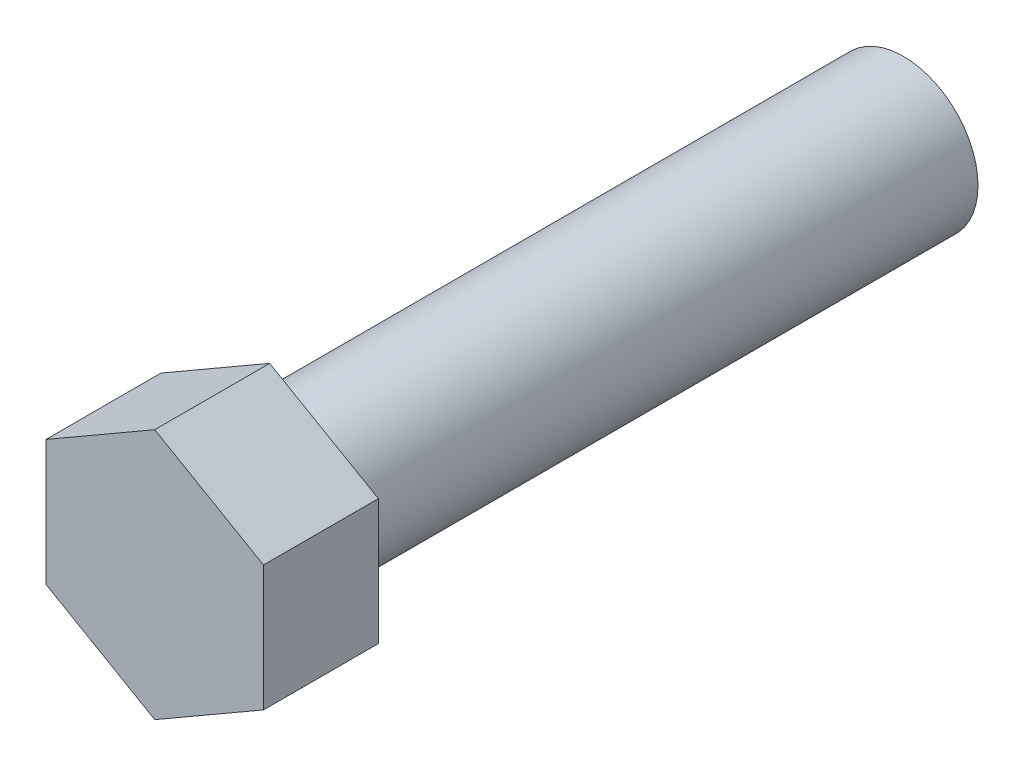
ISO-10303-21;
HEADER;
FILE_DESCRIPTION(('STEP AP214'),'2;1');
FILE_NAME('part.step','',(''),(''),'','','');
FILE_SCHEMA(('AUTOMOTIVE_DESIGN { 1 0 10303 214 1 1 1 1 }'));
ENDSEC;
DATA;
#1=APPLICATION_CONTEXT('core data for automotive mechanical design processes');
#2=APPLICATION_PROTOCOL_DEFINITION('international standard','automotive_design',2000,#1);
#3=PRODUCT_CONTEXT('',#1,'mechanical');
#4=PRODUCT('Part','Part','',(#3));
#5=PRODUCT_RELATED_PRODUCT_CATEGORY('part','',(#4));
#6=PRODUCT_DEFINITION_FORMATION('','',#4);
#7=PRODUCT_DEFINITION_CONTEXT('part definition',#1,'design');
#8=PRODUCT_DEFINITION('design','',#6,#7);
#9=PRODUCT_DEFINITION_SHAPE('','',#8);
#10=(LENGTH_UNIT() NAMED_UNIT(*) SI_UNIT(.MILLI.,.METRE.));
#11=(NAMED_UNIT(*) PLANE_ANGLE_UNIT() SI_UNIT($,.RADIAN.));
#12=(NAMED_UNIT(*) SI_UNIT($,.STERADIAN.) SOLID_ANGLE_UNIT());
#13=UNCERTAINTY_MEASURE_WITH_UNIT(LENGTH_MEASURE(1.E-05),#10,'distance_accuracy_value','');
#14=(GEOMETRIC_REPRESENTATION_CONTEXT(3) GLOBAL_UNCERTAINTY_ASSIGNED_CONTEXT((#13)) GLOBAL_UNIT_ASSIGNED_CONTEXT((#10,
#11,#12)) REPRESENTATION_CONTEXT('',''));
#15=CARTESIAN_POINT('',(0.,0.,0.));
#16=DIRECTION('',(0.,0.,1.));
#17=DIRECTION('',(1.,0.,0.));
#18=AXIS2_PLACEMENT_3D('',#15,#16,#17);
#19=CARTESIAN_POINT('',(55.5625000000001,32.0790243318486,58.7375));
#20=DIRECTION('',(-0.5,-0.866025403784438,0.));
#21=DIRECTION('',(0.866025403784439,-0.5,0.));
#22=AXIS2_PLACEMENT_3D('',#19,#20,#21);
#23=PLANE('',#22);
#24=DIRECTION('',(-0.866025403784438,0.5,0.));
#25=VECTOR('',#24,1.);
#26=CARTESIAN_POINT('',(55.5625000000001,32.0790243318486,0.));
#27=LINE('',#26,#25);
#28=CARTESIAN_POINT('',(55.5625000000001,32.0790243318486,0.));
#29=VERTEX_POINT('',#28);
#30=CARTESIAN_POINT('',(0.,64.1580486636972,0.));
#31=VERTEX_POINT('',#30);
#32=EDGE_CURVE('E133',#29,#31,#27,.T.);
#33=ORIENTED_EDGE('',*,*,#32,.T.);
#34=DIRECTION('',(0.,0.,-1.));
#35=VECTOR('',#34,1.);
#36=CARTESIAN_POINT('',(0.,64.1580486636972,58.7375));
#37=LINE('',#36,#35);
#38=CARTESIAN_POINT('',(0.,64.1580486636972,58.7375));
#39=VERTEX_POINT('',#38);
#40=EDGE_CURVE('E11',#39,#31,#37,.T.);
#41=ORIENTED_EDGE('',*,*,#40,.F.);
#42=DIRECTION('',(-0.866025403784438,0.5,0.));
#43=VECTOR('',#42,1.);
#44=CARTESIAN_POINT('',(55.5625000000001,32.0790243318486,58.7375));
#45=LINE('',#44,#43);
#46=CARTESIAN_POINT('',(55.5625000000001,32.0790243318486,58.7375));
#47=VERTEX_POINT('',#46);
#48=EDGE_CURVE('E151',#47,#39,#45,.T.);
#49=ORIENTED_EDGE('',*,*,#48,.F.);
#50=DIRECTION('',(0.,0.,-1.));
#51=VECTOR('',#50,1.);
#52=CARTESIAN_POINT('',(55.5625000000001,32.0790243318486,58.7375));
#53=LINE('',#52,#51);
#54=EDGE_CURVE('E128',#47,#29,#53,.T.);
#55=ORIENTED_EDGE('',*,*,#54,.T.);
#56=EDGE_LOOP('',(#33,#41,#49,#55));
#57=FACE_BOUND('',#56,.T.);
#58=ADVANCED_FACE('F44',(#57),#23,.F.);
#59=CARTESIAN_POINT('',(0.,64.1580486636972,58.7375));
#60=DIRECTION('',(0.5,-0.866025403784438,0.));
#61=DIRECTION('',(0.866025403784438,0.5,0.));
#62=AXIS2_PLACEMENT_3D('',#59,#60,#61);
#63=PLANE('',#62);
#64=DIRECTION('',(-0.866025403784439,-0.5,0.));
#65=VECTOR('',#64,1.);
#66=CARTESIAN_POINT('',(0.,64.1580486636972,0.));
#67=LINE('',#66,#65);
#68=CARTESIAN_POINT('',(-55.5625000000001,32.0790243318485,0.));
#69=VERTEX_POINT('',#68);
#70=EDGE_CURVE('E138',#31,#69,#67,.T.);
#71=ORIENTED_EDGE('',*,*,#70,.T.);
#72=DIRECTION('',(0.,0.,-1.));
#73=VECTOR('',#72,1.);
#74=CARTESIAN_POINT('',(-55.5625000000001,32.0790243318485,58.7375));
#75=LINE('',#74,#73);
#76=CARTESIAN_POINT('',(-55.5625000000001,32.0790243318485,58.7375));
#77=VERTEX_POINT('',#76);
#78=EDGE_CURVE('E53',#77,#69,#75,.T.);
#79=ORIENTED_EDGE('',*,*,#78,.F.);
#80=DIRECTION('',(-0.866025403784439,-0.5,0.));
#81=VECTOR('',#80,1.);
#82=CARTESIAN_POINT('',(0.,64.1580486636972,58.7375));
#83=LINE('',#82,#81);
#84=EDGE_CURVE('E97',#39,#77,#83,.T.);
#85=ORIENTED_EDGE('',*,*,#84,.F.);
#86=ORIENTED_EDGE('',*,*,#40,.T.);
#87=EDGE_LOOP('',(#71,#79,#85,#86));
#88=FACE_BOUND('',#87,.T.);
#89=ADVANCED_FACE('F177',(#88),#63,.F.);
#90=CARTESIAN_POINT('',(-55.5625000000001,32.0790243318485,58.7375));
#91=DIRECTION('',(1.,0.,0.));
#92=DIRECTION('',(0.,1.,0.));
#93=AXIS2_PLACEMENT_3D('',#90,#91,#92);
#94=PLANE('',#93);
#95=DIRECTION('',(0.,-1.,0.));
#96=VECTOR('',#95,1.);
#97=CARTESIAN_POINT('',(-55.5625000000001,32.0790243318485,0.));
#98=LINE('',#97,#96);
#99=CARTESIAN_POINT('',(-55.5625000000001,-32.0790243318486,0.));
#100=VERTEX_POINT('',#99);
#101=EDGE_CURVE('E142',#69,#100,#98,.T.);
#102=ORIENTED_EDGE('',*,*,#101,.T.);
#103=DIRECTION('',(0.,0.,-1.));
#104=VECTOR('',#103,1.);
#105=CARTESIAN_POINT('',(-55.5625000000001,-32.0790243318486,58.7375));
#106=LINE('',#105,#104);
#107=CARTESIAN_POINT('',(-55.5625000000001,-32.0790243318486,58.7375));
#108=VERTEX_POINT('',#107);
#109=EDGE_CURVE('E123',#108,#100,#106,.T.);
#110=ORIENTED_EDGE('',*,*,#109,.F.);
#111=DIRECTION('',(0.,-1.,0.));
#112=VECTOR('',#111,1.);
#113=CARTESIAN_POINT('',(-55.5625000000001,32.0790243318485,58.7375));
#114=LINE('',#113,#112);
#115=EDGE_CURVE('E115',#77,#108,#114,.T.);
#116=ORIENTED_EDGE('',*,*,#115,.F.);
#117=ORIENTED_EDGE('',*,*,#78,.T.);
#118=EDGE_LOOP('',(#102,#110,#116,#117));
#119=FACE_BOUND('',#118,.T.);
#120=ADVANCED_FACE('F161',(#119),#94,.F.);
#121=CARTESIAN_POINT('',(-55.5625000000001,-32.0790243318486,58.7375));
#122=DIRECTION('',(0.5,0.866025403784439,0.));
#123=DIRECTION('',(-0.866025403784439,0.5,0.));
#124=AXIS2_PLACEMENT_3D('',#121,#122,#123);
#125=PLANE('',#124);
#126=DIRECTION('',(0.866025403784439,-0.5,0.));
#127=VECTOR('',#126,1.);
#128=CARTESIAN_POINT('',(-55.5625000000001,-32.0790243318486,0.));
#129=LINE('',#128,#127);
#130=CARTESIAN_POINT('',(0.,-64.1580486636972,0.));
#131=VERTEX_POINT('',#130);
#132=EDGE_CURVE('E121',#100,#131,#129,.T.);
#133=ORIENTED_EDGE('',*,*,#132,.T.);
#134=DIRECTION('',(0.,0.,-1.));
#135=VECTOR('',#134,1.);
#136=CARTESIAN_POINT('',(0.,-64.1580486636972,58.7375));
#137=LINE('',#136,#135);
#138=CARTESIAN_POINT('',(0.,-64.1580486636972,58.7375));
#139=VERTEX_POINT('',#138);
#140=EDGE_CURVE('E119',#139,#131,#137,.T.);
#141=ORIENTED_EDGE('',*,*,#140,.F.);
#142=DIRECTION('',(0.866025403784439,-0.5,0.));
#143=VECTOR('',#142,1.);
#144=CARTESIAN_POINT('',(-55.5625000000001,-32.0790243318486,58.7375));
#145=LINE('',#144,#143);
#146=EDGE_CURVE('E106',#108,#139,#145,.T.);
#147=ORIENTED_EDGE('',*,*,#146,.F.);
#148=ORIENTED_EDGE('',*,*,#109,.T.);
#149=EDGE_LOOP('',(#133,#141,#147,#148));
#150=FACE_BOUND('',#149,.T.);
#151=ADVANCED_FACE('F118',(#150),#125,.F.);
#152=CARTESIAN_POINT('',(0.,-64.1580486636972,58.7375));
#153=DIRECTION('',(-0.5,0.866025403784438,0.));
#154=DIRECTION('',(-0.866025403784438,-0.5,0.));
#155=AXIS2_PLACEMENT_3D('',#152,#153,#154);
#156=PLANE('',#155);
#157=DIRECTION('',(0.866025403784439,0.5,0.));
#158=VECTOR('',#157,1.);
#159=CARTESIAN_POINT('',(0.,-64.1580486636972,0.));
#160=LINE('',#159,#158);
#161=CARTESIAN_POINT('',(55.5625,-32.0790243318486,0.));
#162=VERTEX_POINT('',#161);
#163=EDGE_CURVE('E84',#131,#162,#160,.T.);
#164=ORIENTED_EDGE('',*,*,#163,.T.);
#165=DIRECTION('',(0.,0.,-1.));
#166=VECTOR('',#165,1.);
#167=CARTESIAN_POINT('',(55.5625,-32.0790243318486,58.7375));
#168=LINE('',#167,#166);
#169=CARTESIAN_POINT('',(55.5625,-32.0790243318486,58.7375));
#170=VERTEX_POINT('',#169);
#171=EDGE_CURVE('E122',#170,#162,#168,.T.);
#172=ORIENTED_EDGE('',*,*,#171,.F.);
#173=DIRECTION('',(0.866025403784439,0.5,0.));
#174=VECTOR('',#173,1.);
#175=CARTESIAN_POINT('',(0.,-64.1580486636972,58.7375));
#176=LINE('',#175,#174);
#177=EDGE_CURVE('E109',#139,#170,#176,.T.);
#178=ORIENTED_EDGE('',*,*,#177,.F.);
#179=ORIENTED_EDGE('',*,*,#140,.T.);
#180=EDGE_LOOP('',(#164,#172,#178,#179));
#181=FACE_BOUND('',#180,.T.);
#182=ADVANCED_FACE('F127',(#181),#156,.F.);
#183=CARTESIAN_POINT('',(55.5625,-32.0790243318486,58.7375));
#184=DIRECTION('',(-1.,0.,0.));
#185=DIRECTION('',(0.,-1.,0.));
#186=AXIS2_PLACEMENT_3D('',#183,#184,#185);
#187=PLANE('',#186);
#188=DIRECTION('',(0.,1.,0.));
#189=VECTOR('',#188,1.);
#190=CARTESIAN_POINT('',(55.5625,-32.0790243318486,0.));
#191=LINE('',#190,#189);
#192=EDGE_CURVE('E93',#162,#29,#191,.T.);
#193=ORIENTED_EDGE('',*,*,#192,.T.);
#194=ORIENTED_EDGE('',*,*,#54,.F.);
#195=DIRECTION('',(0.,1.,0.));
#196=VECTOR('',#195,1.);
#197=CARTESIAN_POINT('',(55.5625,-32.0790243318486,58.7375));
#198=LINE('',#197,#196);
#199=EDGE_CURVE('E62',#170,#47,#198,.T.);
#200=ORIENTED_EDGE('',*,*,#199,.F.);
#201=ORIENTED_EDGE('',*,*,#171,.T.);
#202=EDGE_LOOP('',(#193,#194,#200,#201));
#203=FACE_BOUND('',#202,.T.);
#204=ADVANCED_FACE('F169',(#203),#187,.F.);
#205=CARTESIAN_POINT('',(0.,0.,58.7375));
#206=DIRECTION('',(0.,0.,1.));
#207=DIRECTION('',(1.,0.,0.));
#208=AXIS2_PLACEMENT_3D('',#205,#206,#207);
#209=PLANE('',#208);
#210=ORIENTED_EDGE('',*,*,#48,.T.);
#211=ORIENTED_EDGE('',*,*,#84,.T.);
#212=ORIENTED_EDGE('',*,*,#115,.T.);
#213=ORIENTED_EDGE('',*,*,#146,.T.);
#214=ORIENTED_EDGE('',*,*,#177,.T.);
#215=ORIENTED_EDGE('',*,*,#199,.T.);
#216=EDGE_LOOP('',(#210,#211,#212,#213,#214,#215));
#217=FACE_BOUND('',#216,.T.);
#218=ADVANCED_FACE('F107',(#217),#209,.T.);
#219=CARTESIAN_POINT('',(0.,0.,0.));
#220=DIRECTION('',(0.,0.,1.));
#221=DIRECTION('',(1.,0.,0.));
#222=AXIS2_PLACEMENT_3D('',#219,#220,#221);
#223=PLANE('',#222);
#224=CARTESIAN_POINT('',(0.,0.,0.));
#225=DIRECTION('',(0.,0.,1.));
#226=DIRECTION('',(1.,0.,0.));
#227=AXIS2_PLACEMENT_3D('',#224,#225,#226);
#228=CIRCLE('',#227,38.1);
#229=CARTESIAN_POINT('',(38.1,0.,0.));
#230=VERTEX_POINT('',#229);
#231=EDGE_CURVE('E244',#230,#230,#228,.T.);
#232=ORIENTED_EDGE('',*,*,#231,.T.);
#233=EDGE_LOOP('',(#232));
#234=FACE_BOUND('',#233,.T.);
#235=ORIENTED_EDGE('',*,*,#32,.F.);
#236=ORIENTED_EDGE('',*,*,#192,.F.);
#237=ORIENTED_EDGE('',*,*,#163,.F.);
#238=ORIENTED_EDGE('',*,*,#132,.F.);
#239=ORIENTED_EDGE('',*,*,#101,.F.);
#240=ORIENTED_EDGE('',*,*,#70,.F.);
#241=EDGE_LOOP('',(#235,#236,#237,#238,#239,#240));
#242=FACE_BOUND('',#241,.T.);
#243=ADVANCED_FACE('F163',(#234,#242),#223,.F.);
#244=CARTESIAN_POINT('',(0.,0.,-323.85));
#245=DIRECTION('',(0.,0.,1.));
#246=DIRECTION('',(1.,0.,0.));
#247=AXIS2_PLACEMENT_3D('',#244,#245,#246);
#248=CYLINDRICAL_SURFACE('',#247,38.1);
#249=CARTESIAN_POINT('',(0.,0.,-323.85));
#250=DIRECTION('',(0.,0.,1.));
#251=DIRECTION('',(1.,0.,0.));
#252=AXIS2_PLACEMENT_3D('',#249,#250,#251);
#253=CIRCLE('',#252,38.1);
#254=CARTESIAN_POINT('',(38.1,0.,-323.85));
#255=VERTEX_POINT('',#254);
#256=EDGE_CURVE('E137',#255,#255,#253,.T.);
#257=ORIENTED_EDGE('',*,*,#256,.T.);
#258=EDGE_LOOP('',(#257));
#259=FACE_BOUND('',#258,.T.);
#260=ORIENTED_EDGE('',*,*,#231,.F.);
#261=EDGE_LOOP('',(#260));
#262=FACE_BOUND('',#261,.T.);
#263=ADVANCED_FACE('F217',(#259,#262),#248,.T.);
#264=CARTESIAN_POINT('',(0.,0.,-323.85));
#265=DIRECTION('',(0.,0.,1.));
#266=DIRECTION('',(1.,0.,0.));
#267=AXIS2_PLACEMENT_3D('',#264,#265,#266);
#268=PLANE('',#267);
#269=ORIENTED_EDGE('',*,*,#256,.F.);
#270=EDGE_LOOP('',(#269));
#271=FACE_BOUND('',#270,.T.);
#272=ADVANCED_FACE('F227',(#271),#268,.F.);
#273=CLOSED_SHELL('',(#58,#89,#120,#151,#182,#204,#218,#243,#263,#272));
#274=MANIFOLD_SOLID_BREP('B2',#273);
#275=ADVANCED_BREP_SHAPE_REPRESENTATION('',(#18,#274),#14);
#276=SHAPE_DEFINITION_REPRESENTATION(#9,#275);
ENDSEC;
END-ISO-10303-21;
